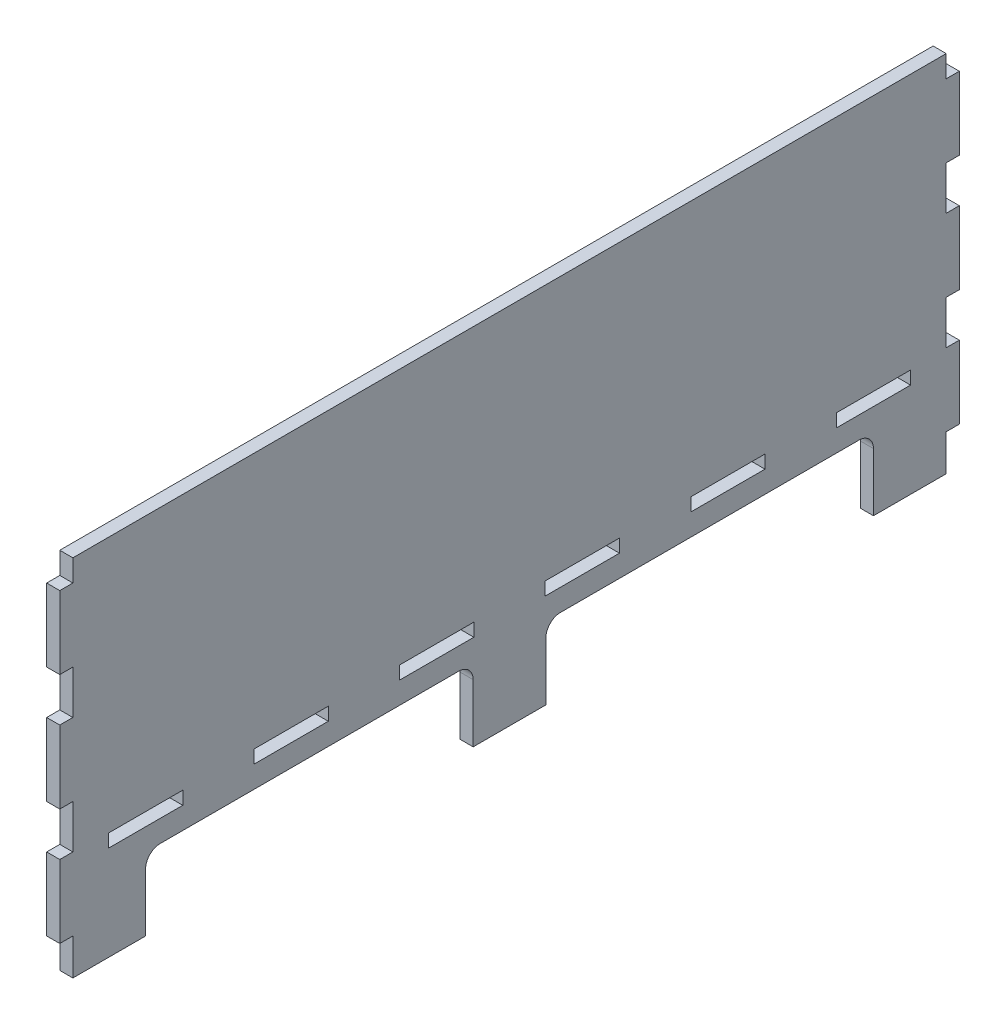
from build123d import *

# Parameters (mm, degrees)
BOSS_EXTRUDE1_DEPTH = 9
SKETCH2_W           = 51
SKETCH2_H           = 9
CUT_EXTRUDE1_DEPTH  = 424.40920457
LPATTERN1_COUNT     = 6
LPATTERN1_PITCH     = 100


with BuildPart() as part:
    # Sketch1 → Boss-Extrude1 (new body)
    with BuildSketch(Plane(origin=(0, 0, 0), x_dir=(0, 0, -1), z_dir=(1, 0, 0))):
        with BuildLine():
            Line((-300, -264.332601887), (-300, -289.332601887))
            Line((-300, -289.332601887), (-250, -289.332601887))
            Line((-250, -289.332601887), (-250, -249.332601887))
            ThreePointArc((-250, -249.332601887), (-247.071067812, -242.261534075), (-240, -239.332601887))
            Line((-240, -239.332601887), (-35, -239.332601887))
            ThreePointArc((-35, -239.332601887), (-27.928932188, -242.261534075), (-25, -249.332601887))
            Line((-25, -249.332601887), (-25, -289.332601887))
            Line((-25, -289.332601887), (25, -289.332601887))
            Line((25, -289.332601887), (25, -249.332601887))
            ThreePointArc((25, -249.332601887), (27.928932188, -242.261534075), (35, -239.332601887))
            Line((35, -239.332601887), (240, -239.332601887))
            ThreePointArc((240, -239.332601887), (247.071067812, -242.261534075), (250, -249.332601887))
            Line((250, -249.332601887), (250, -289.332601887))
            Line((250, -289.332601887), (300, -289.332601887))
            Line((300, -289.332601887), (300, -264.332601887))
            Line((300, -264.332601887), (309, -264.332601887))
            Line((309, -264.332601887), (309, -214.332601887))
            Line((309, -214.332601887), (300, -214.332601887))
            Line((300, -214.332601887), (300, -184.332601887))
            Line((300, -184.332601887), (309, -184.332601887))
            Line((309, -184.332601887), (309, -134.332601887))
            Line((309, -134.332601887), (300, -134.332601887))
            Line((300, -134.332601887), (300, -104.332601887))
            Line((300, -104.332601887), (309, -104.332601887))
            Line((309, -104.332601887), (309, -54.332601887))
            Line((309, -54.332601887), (300, -54.332601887))
            Line((300, -54.332601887), (300, -39.332601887))
            Line((300, -39.332601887), (-300, -39.332601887))
            Line((-300, -39.332601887), (-300, -54.332601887))
            Line((-300, -54.332601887), (-309, -54.332601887))
            Line((-309, -54.332601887), (-309, -104.332601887))
            Line((-309, -104.332601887), (-300, -104.332601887))
            Line((-300, -104.332601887), (-300, -134.332601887))
            Line((-300, -134.332601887), (-309, -134.332601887))
            Line((-309, -134.332601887), (-309, -184.332601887))
            Line((-309, -184.332601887), (-300, -184.332601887))
            Line((-300, -184.332601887), (-300, -214.332601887))
            Line((-300, -214.332601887), (-309, -214.332601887))
            Line((-309, -214.332601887), (-309, -264.332601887))
            Line((-309, -264.332601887), (-300, -264.332601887))
        make_face()
    extrude(amount=BOSS_EXTRUDE1_DEPTH)

    # Sketch2 → Cut-Extrude1 (cut, through all)
    with BuildSketch(Plane(origin=(9, 0, 0), x_dir=(0, 0, -1), z_dir=(1, 0, 0))):
        with Locations((-250, -219.832601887)):
            Rectangle(SKETCH2_W, SKETCH2_H)
    cut_extrude1 = extrude(amount=-CUT_EXTRUDE1_DEPTH, mode=Mode.SUBTRACT)

    # LPattern1: Cut-Extrude1 ×6
    with Locations(*[(0, 0, -i * LPATTERN1_PITCH) for i in range(1, LPATTERN1_COUNT)]):
        add(cut_extrude1, mode=Mode.SUBTRACT)


solid = part.part
